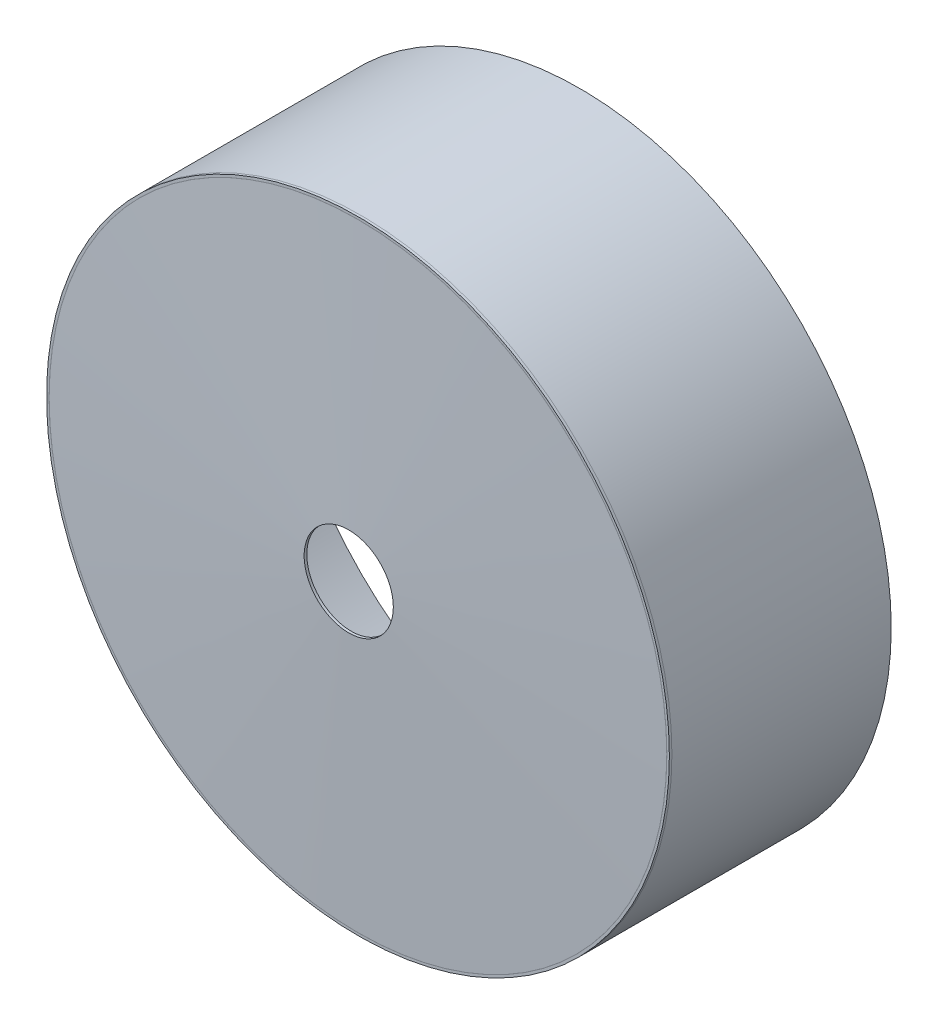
ISO-10303-21;
HEADER;
FILE_DESCRIPTION(('STEP AP214'),'2;1');
FILE_NAME('part.step','',(''),(''),'','','');
FILE_SCHEMA(('AUTOMOTIVE_DESIGN { 1 0 10303 214 1 1 1 1 }'));
ENDSEC;
DATA;
#1=APPLICATION_CONTEXT('core data for automotive mechanical design processes');
#2=APPLICATION_PROTOCOL_DEFINITION('international standard','automotive_design',2000,#1);
#3=PRODUCT_CONTEXT('',#1,'mechanical');
#4=PRODUCT('Part','Part','',(#3));
#5=PRODUCT_RELATED_PRODUCT_CATEGORY('part','',(#4));
#6=PRODUCT_DEFINITION_FORMATION('','',#4);
#7=PRODUCT_DEFINITION_CONTEXT('part definition',#1,'design');
#8=PRODUCT_DEFINITION('design','',#6,#7);
#9=PRODUCT_DEFINITION_SHAPE('','',#8);
#10=(LENGTH_UNIT() NAMED_UNIT(*) SI_UNIT(.MILLI.,.METRE.));
#11=(NAMED_UNIT(*) PLANE_ANGLE_UNIT() SI_UNIT($,.RADIAN.));
#12=(NAMED_UNIT(*) SI_UNIT($,.STERADIAN.) SOLID_ANGLE_UNIT());
#13=UNCERTAINTY_MEASURE_WITH_UNIT(LENGTH_MEASURE(1.E-05),#10,'distance_accuracy_value','');
#14=(GEOMETRIC_REPRESENTATION_CONTEXT(3) GLOBAL_UNCERTAINTY_ASSIGNED_CONTEXT((#13)) GLOBAL_UNIT_ASSIGNED_CONTEXT((#10,
#11,#12)) REPRESENTATION_CONTEXT('',''));
#15=CARTESIAN_POINT('',(0.,0.,0.));
#16=DIRECTION('',(0.,0.,1.));
#17=DIRECTION('',(1.,0.,0.));
#18=AXIS2_PLACEMENT_3D('',#15,#16,#17);
#19=CARTESIAN_POINT('',(0.,0.,43.68));
#20=DIRECTION('',(0.,0.,1.));
#21=DIRECTION('',(1.,0.,0.));
#22=AXIS2_PLACEMENT_3D('',#19,#20,#21);
#23=PLANE('',#22);
#24=CARTESIAN_POINT('',(0.,0.,43.68));
#25=DIRECTION('',(0.,0.,1.));
#26=DIRECTION('',(1.,0.,0.));
#27=AXIS2_PLACEMENT_3D('',#24,#25,#26);
#28=CIRCLE('',#27,60.8165177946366);
#29=CARTESIAN_POINT('',(60.8165177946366,0.,43.68));
#30=VERTEX_POINT('',#29);
#31=EDGE_CURVE('E13',#30,#30,#28,.T.);
#32=ORIENTED_EDGE('',*,*,#31,.F.);
#33=EDGE_LOOP('',(#32));
#34=FACE_BOUND('',#33,.T.);
#35=CARTESIAN_POINT('',(0.,0.,43.68));
#36=DIRECTION('',(0.,0.,1.));
#37=DIRECTION('',(1.,0.,0.));
#38=AXIS2_PLACEMENT_3D('',#35,#36,#37);
#39=CIRCLE('',#38,61.3077902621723);
#40=CARTESIAN_POINT('',(61.3077902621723,0.,43.68));
#41=VERTEX_POINT('',#40);
#42=EDGE_CURVE('E111',#41,#41,#39,.T.);
#43=ORIENTED_EDGE('',*,*,#42,.T.);
#44=EDGE_LOOP('',(#43));
#45=FACE_BOUND('',#44,.T.);
#46=ADVANCED_FACE('F103',(#34,#45),#23,.T.);
#47=CARTESIAN_POINT('',(0.,0.,43.18));
#48=DIRECTION('',(0.,0.,1.));
#49=DIRECTION('',(1.,0.,0.));
#50=AXIS2_PLACEMENT_3D('',#47,#48,#49);
#51=PLANE('',#50);
#52=CARTESIAN_POINT('',(0.,0.,43.18));
#53=DIRECTION('',(0.,0.,1.));
#54=DIRECTION('',(1.,0.,0.));
#55=AXIS2_PLACEMENT_3D('',#52,#53,#54);
#56=CIRCLE('',#55,60.8165177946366);
#57=CARTESIAN_POINT('',(60.8165177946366,0.,43.18));
#58=VERTEX_POINT('',#57);
#59=EDGE_CURVE('E194',#58,#58,#56,.T.);
#60=ORIENTED_EDGE('',*,*,#59,.T.);
#61=EDGE_LOOP('',(#60));
#62=FACE_BOUND('',#61,.T.);
#63=CARTESIAN_POINT('',(0.,0.,43.18));
#64=DIRECTION('',(0.,0.,1.));
#65=DIRECTION('',(1.,0.,0.));
#66=AXIS2_PLACEMENT_3D('',#63,#64,#65);
#67=CIRCLE('',#66,61.3077902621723);
#68=CARTESIAN_POINT('',(61.3077902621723,0.,43.18));
#69=VERTEX_POINT('',#68);
#70=EDGE_CURVE('E142',#69,#69,#67,.T.);
#71=ORIENTED_EDGE('',*,*,#70,.F.);
#72=EDGE_LOOP('',(#71));
#73=FACE_BOUND('',#72,.T.);
#74=ADVANCED_FACE('F162',(#62,#73),#51,.F.);
#75=CARTESIAN_POINT('',(0.,0.,43.68));
#76=DIRECTION('',(0.,0.,-1.));
#77=DIRECTION('',(-1.,0.,0.));
#78=AXIS2_PLACEMENT_3D('',#75,#76,#77);
#79=CYLINDRICAL_SURFACE('',#78,61.3077902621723);
#80=ORIENTED_EDGE('',*,*,#42,.F.);
#81=EDGE_LOOP('',(#80));
#82=FACE_BOUND('',#81,.T.);
#83=ORIENTED_EDGE('',*,*,#70,.T.);
#84=EDGE_LOOP('',(#83));
#85=FACE_BOUND('',#84,.T.);
#86=ADVANCED_FACE('F105',(#82,#85),#79,.T.);
#87=CARTESIAN_POINT('',(0.,0.,45.4969122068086));
#88=DIRECTION('',(0.,0.,1.));
#89=DIRECTION('',(1.,0.,0.));
#90=AXIS2_PLACEMENT_3D('',#87,#88,#89);
#91=CONICAL_SURFACE('',#90,8.77823211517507,0.0349065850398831);
#92=CARTESIAN_POINT('',(0.,0.,45.4969122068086));
#93=DIRECTION('',(0.,0.,1.));
#94=DIRECTION('',(1.,0.,0.));
#95=AXIS2_PLACEMENT_3D('',#92,#93,#94);
#96=CIRCLE('',#95,8.77823211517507);
#97=CARTESIAN_POINT('',(8.77823211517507,0.,45.4969122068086));
#98=VERTEX_POINT('',#97);
#99=EDGE_CURVE('E139',#98,#98,#96,.T.);
#100=ORIENTED_EDGE('',*,*,#99,.T.);
#101=DIRECTION('',(-0.0348994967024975,0.,-0.999390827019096));
#102=VECTOR('',#101,1.);
#103=CARTESIAN_POINT('',(8.77823211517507,0.,45.4969122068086));
#104=LINE('',#103,#102);
#105=CARTESIAN_POINT('',(8.76078236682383,0.,44.9972167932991));
#106=VERTEX_POINT('',#105);
#107=EDGE_CURVE('E126',#98,#106,#104,.T.);
#108=ORIENTED_EDGE('',*,*,#107,.T.);
#109=CARTESIAN_POINT('',(0.,0.,44.9972167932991));
#110=DIRECTION('',(0.,0.,-1.));
#111=DIRECTION('',(-1.,0.,0.));
#112=AXIS2_PLACEMENT_3D('',#109,#110,#111);
#113=CIRCLE('',#112,8.76078236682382);
#114=EDGE_CURVE('E140',#106,#106,#113,.F.);
#115=ORIENTED_EDGE('',*,*,#114,.F.);
#116=ORIENTED_EDGE('',*,*,#107,.F.);
#117=EDGE_LOOP('',(#100,#108,#115,#116));
#118=FACE_BOUND('',#117,.T.);
#119=ADVANCED_FACE('F137',(#118),#91,.F.);
#120=CARTESIAN_POINT('',(0.,0.,43.1806091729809));
#121=DIRECTION('',(0.,0.,-1.));
#122=DIRECTION('',(-1.,0.,0.));
#123=AXIS2_PLACEMENT_3D('',#120,#121,#122);
#124=CONICAL_SURFACE('',#123,60.7816182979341,1.53588974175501);
#125=DIRECTION('',(0.999390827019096,0.,-0.0348994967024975));
#126=VECTOR('',#125,1.);
#127=CARTESIAN_POINT('',(60.7816182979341,0.,43.1806091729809));
#128=LINE('',#127,#126);
#129=CARTESIAN_POINT('',(60.7816182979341,0.,43.1806091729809));
#130=VERTEX_POINT('',#129);
#131=EDGE_CURVE('E192',#130,#106,#128,.F.);
#132=ORIENTED_EDGE('',*,*,#131,.F.);
#133=CARTESIAN_POINT('',(0.,0.,43.1806091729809));
#134=DIRECTION('',(0.,0.,1.));
#135=DIRECTION('',(1.,0.,0.));
#136=AXIS2_PLACEMENT_3D('',#133,#134,#135);
#137=CIRCLE('',#136,60.7816182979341);
#138=EDGE_CURVE('E193',#130,#130,#137,.T.);
#139=ORIENTED_EDGE('',*,*,#138,.F.);
#140=ORIENTED_EDGE('',*,*,#131,.T.);
#141=ORIENTED_EDGE('',*,*,#114,.T.);
#142=EDGE_LOOP('',(#132,#139,#140,#141));
#143=FACE_BOUND('',#142,.T.);
#144=ADVANCED_FACE('F176',(#143),#124,.F.);
#145=CARTESIAN_POINT('',(0.,0.,44.18));
#146=DIRECTION('',(0.,0.,1.));
#147=DIRECTION('',(1.,0.,0.));
#148=AXIS2_PLACEMENT_3D('',#145,#146,#147);
#149=TOROIDAL_SURFACE('',#148,60.8165177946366,1.);
#150=CARTESIAN_POINT('',(60.8165177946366,0.,44.18));
#151=DIRECTION('',(0.,-1.,0.));
#152=DIRECTION('',(0.,0.,-1.));
#153=AXIS2_PLACEMENT_3D('',#150,#151,#152);
#154=CIRCLE('',#153,1.);
#155=EDGE_CURVE('E118',#58,#130,#154,.F.);
#156=ORIENTED_EDGE('',*,*,#155,.F.);
#157=ORIENTED_EDGE('',*,*,#59,.F.);
#158=ORIENTED_EDGE('',*,*,#155,.T.);
#159=ORIENTED_EDGE('',*,*,#138,.T.);
#160=EDGE_LOOP('',(#156,#157,#158,#159));
#161=FACE_BOUND('',#160,.T.);
#162=ADVANCED_FACE('F180',(#161),#149,.T.);
#163=CARTESIAN_POINT('',(0.,0.,43.6803045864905));
#164=DIRECTION('',(0.,0.,-1.));
#165=DIRECTION('',(-1.,0.,0.));
#166=AXIS2_PLACEMENT_3D('',#163,#164,#165);
#167=CONICAL_SURFACE('',#166,60.7990680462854,1.53588974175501);
#168=DIRECTION('',(-0.999390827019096,0.,0.0348994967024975));
#169=VECTOR('',#168,1.);
#170=CARTESIAN_POINT('',(60.8077902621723,0.,43.68));
#171=LINE('',#170,#169);
#172=CARTESIAN_POINT('',(60.7990680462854,0.,43.6803045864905));
#173=VERTEX_POINT('',#172);
#174=EDGE_CURVE('E147',#173,#98,#171,.T.);
#175=ORIENTED_EDGE('',*,*,#174,.T.);
#176=ORIENTED_EDGE('',*,*,#99,.F.);
#177=ORIENTED_EDGE('',*,*,#174,.F.);
#178=CARTESIAN_POINT('',(0.,0.,43.6803045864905));
#179=DIRECTION('',(0.,0.,1.));
#180=DIRECTION('',(1.,0.,0.));
#181=AXIS2_PLACEMENT_3D('',#178,#179,#180);
#182=CIRCLE('',#181,60.7990680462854);
#183=EDGE_CURVE('E150',#173,#173,#182,.T.);
#184=ORIENTED_EDGE('',*,*,#183,.T.);
#185=EDGE_LOOP('',(#175,#176,#177,#184));
#186=FACE_BOUND('',#185,.T.);
#187=ADVANCED_FACE('F148',(#186),#167,.T.);
#188=CARTESIAN_POINT('',(0.,0.,44.18));
#189=DIRECTION('',(0.,0.,1.));
#190=DIRECTION('',(1.,0.,0.));
#191=AXIS2_PLACEMENT_3D('',#188,#189,#190);
#192=TOROIDAL_SURFACE('',#191,60.8165177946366,0.5);
#193=CARTESIAN_POINT('',(60.8165177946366,0.,44.18));
#194=DIRECTION('',(0.,-1.,0.));
#195=DIRECTION('',(0.,0.,-1.));
#196=AXIS2_PLACEMENT_3D('',#193,#194,#195);
#197=CIRCLE('',#196,0.5);
#198=EDGE_CURVE('E151',#30,#173,#197,.F.);
#199=ORIENTED_EDGE('',*,*,#198,.T.);
#200=ORIENTED_EDGE('',*,*,#183,.F.);
#201=ORIENTED_EDGE('',*,*,#198,.F.);
#202=ORIENTED_EDGE('',*,*,#31,.T.);
#203=EDGE_LOOP('',(#199,#200,#201,#202));
#204=FACE_BOUND('',#203,.T.);
#205=ADVANCED_FACE('F179',(#204),#192,.F.);
#206=CLOSED_SHELL('',(#46,#74,#86,#119,#144,#162,#187,#205));
#207=MANIFOLD_SOLID_BREP('B2',#206);
#208=CARTESIAN_POINT('',(0.,0.,43.18));
#209=DIRECTION('',(0.,0.,1.));
#210=DIRECTION('',(1.,0.,0.));
#211=AXIS2_PLACEMENT_3D('',#208,#209,#210);
#212=PLANE('',#211);
#213=CARTESIAN_POINT('',(0.,0.,43.18));
#214=DIRECTION('',(0.,0.,1.));
#215=DIRECTION('',(1.,0.,0.));
#216=AXIS2_PLACEMENT_3D('',#213,#214,#215);
#217=CIRCLE('',#216,61.3077902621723);
#218=CARTESIAN_POINT('',(61.3077902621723,0.,43.18));
#219=VERTEX_POINT('',#218);
#220=EDGE_CURVE('E102',#219,#219,#217,.T.);
#221=ORIENTED_EDGE('',*,*,#220,.T.);
#222=EDGE_LOOP('',(#221));
#223=FACE_BOUND('',#222,.T.);
#224=CARTESIAN_POINT('',(0.,0.,43.18));
#225=DIRECTION('',(0.,0.,1.));
#226=DIRECTION('',(1.,0.,0.));
#227=AXIS2_PLACEMENT_3D('',#224,#225,#226);
#228=CIRCLE('',#227,60.8077902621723);
#229=CARTESIAN_POINT('',(60.8077902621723,0.,43.18));
#230=VERTEX_POINT('',#229);
#231=EDGE_CURVE('E276',#230,#230,#228,.T.);
#232=ORIENTED_EDGE('',*,*,#231,.F.);
#233=EDGE_LOOP('',(#232));
#234=FACE_BOUND('',#233,.T.);
#235=ADVANCED_FACE('F265',(#223,#234),#212,.T.);
#236=CARTESIAN_POINT('',(0.,0.,0.));
#237=DIRECTION('',(0.,0.,1.));
#238=DIRECTION('',(1.,0.,0.));
#239=AXIS2_PLACEMENT_3D('',#236,#237,#238);
#240=PLANE('',#239);
#241=CARTESIAN_POINT('',(0.,0.,0.));
#242=DIRECTION('',(0.,0.,1.));
#243=DIRECTION('',(1.,0.,0.));
#244=AXIS2_PLACEMENT_3D('',#241,#242,#243);
#245=CIRCLE('',#244,61.3077902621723);
#246=CARTESIAN_POINT('',(61.3077902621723,0.,0.));
#247=VERTEX_POINT('',#246);
#248=EDGE_CURVE('E269',#247,#247,#245,.T.);
#249=ORIENTED_EDGE('',*,*,#248,.F.);
#250=EDGE_LOOP('',(#249));
#251=FACE_BOUND('',#250,.T.);
#252=CARTESIAN_POINT('',(0.,0.,0.));
#253=DIRECTION('',(0.,0.,1.));
#254=DIRECTION('',(1.,0.,0.));
#255=AXIS2_PLACEMENT_3D('',#252,#253,#254);
#256=CIRCLE('',#255,60.8077902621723);
#257=CARTESIAN_POINT('',(60.8077902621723,0.,0.));
#258=VERTEX_POINT('',#257);
#259=EDGE_CURVE('E278',#258,#258,#256,.T.);
#260=ORIENTED_EDGE('',*,*,#259,.T.);
#261=EDGE_LOOP('',(#260));
#262=FACE_BOUND('',#261,.T.);
#263=ADVANCED_FACE('F288',(#251,#262),#240,.F.);
#264=CARTESIAN_POINT('',(0.,0.,43.18));
#265=DIRECTION('',(0.,0.,-1.));
#266=DIRECTION('',(-1.,0.,0.));
#267=AXIS2_PLACEMENT_3D('',#264,#265,#266);
#268=CYLINDRICAL_SURFACE('',#267,61.3077902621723);
#269=ORIENTED_EDGE('',*,*,#220,.F.);
#270=EDGE_LOOP('',(#269));
#271=FACE_BOUND('',#270,.T.);
#272=ORIENTED_EDGE('',*,*,#248,.T.);
#273=EDGE_LOOP('',(#272));
#274=FACE_BOUND('',#273,.T.);
#275=ADVANCED_FACE('F267',(#271,#274),#268,.T.);
#276=CARTESIAN_POINT('',(0.,0.,43.18));
#277=DIRECTION('',(0.,0.,-1.));
#278=DIRECTION('',(-1.,0.,0.));
#279=AXIS2_PLACEMENT_3D('',#276,#277,#278);
#280=CYLINDRICAL_SURFACE('',#279,60.8077902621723);
#281=ORIENTED_EDGE('',*,*,#231,.T.);
#282=EDGE_LOOP('',(#281));
#283=FACE_BOUND('',#282,.T.);
#284=ORIENTED_EDGE('',*,*,#259,.F.);
#285=EDGE_LOOP('',(#284));
#286=FACE_BOUND('',#285,.T.);
#287=ADVANCED_FACE('F284',(#283,#286),#280,.F.);
#288=CLOSED_SHELL('',(#235,#263,#275,#287));
#289=MANIFOLD_SOLID_BREP('B7',#288);
#290=ADVANCED_BREP_SHAPE_REPRESENTATION('',(#18,#207,#289),#14);
#291=SHAPE_DEFINITION_REPRESENTATION(#9,#290);
ENDSEC;
END-ISO-10303-21;
